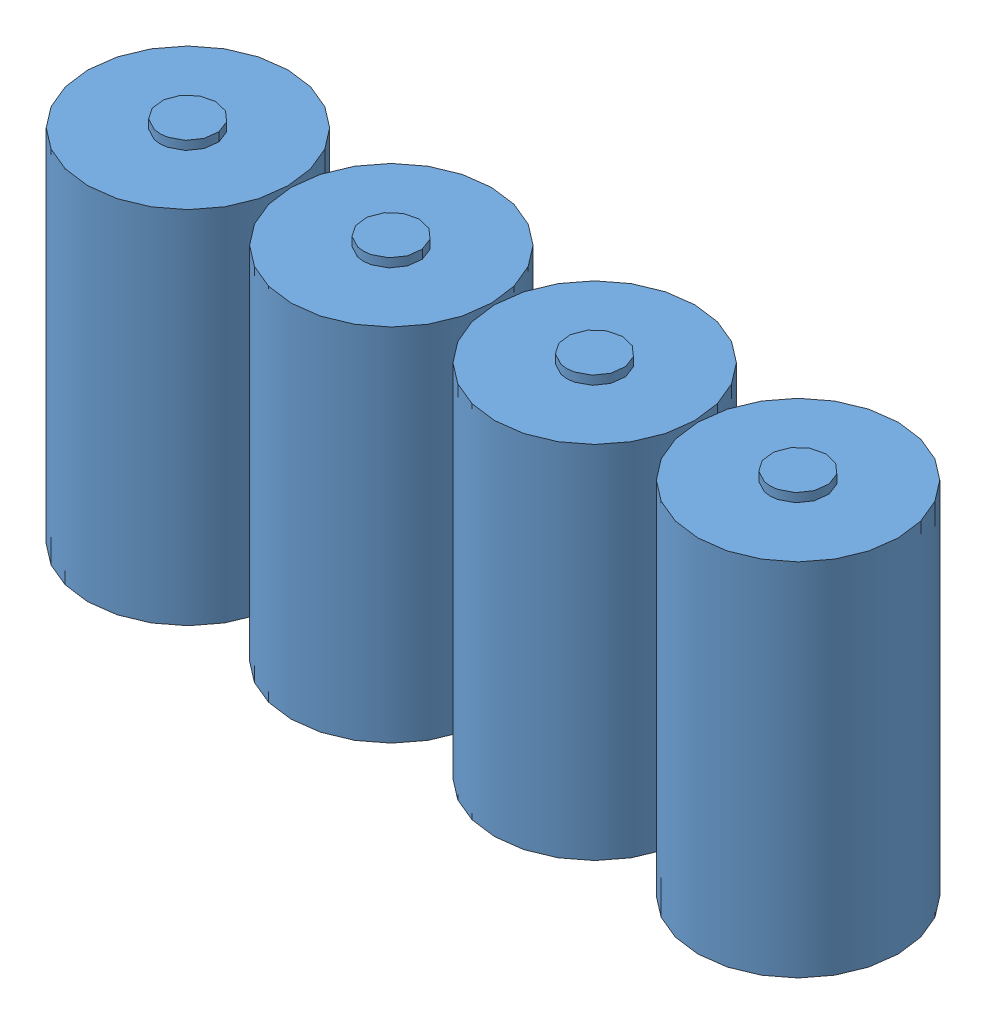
SolidWorks assembly MX1300 4 pack.SLDASM, configuration Default (file format 5000). Lengths in mm.
Overall size (138.32 63 34.2).
4 component instances, 1 part files, 11 mates.
Components (placement in the parent):
- Duracell MX1300 Alk-1: Duracell MX1300 Alk.SLDPRT [Default] at (13.6671 0 17.1) size (34.2 63 34.2)
- Duracell MX1300 Alk-2: Duracell MX1300 Alk.SLDPRT [Default] at (-21.0409 0 17.1) size (34.2 63 34.2)
- Duracell MX1300 Alk-3: Duracell MX1300 Alk.SLDPRT [Default] at (-55.7489 0 17.1) size (34.2 63 34.2)
- Duracell MX1300 Alk-4: Duracell MX1300 Alk.SLDPRT [Default] at (-90.4569 0 17.1) size (34.2 63 34.2)
Mates (geometry in assembly coordinates):
- Coincident2: coincident anti-aligned: plane of Duracell MX1300 Alk-4; plane of assembly
- Coincident3: coincident anti-aligned: plane of Duracell MX1300 Alk-3; plane of assembly
- Coincident4: coincident anti-aligned: plane of Duracell MX1300 Alk-2; plane of assembly
- Coincident6: coincident anti-aligned: plane of Duracell MX1300 Alk-1; plane of assembly
- Distance4: distance anti-aligned: cylinder of Duracell MX1300 Alk-4; plane of assembly
- Tangent2: tangent anti-aligned: cylinder of Duracell MX1300 Alk-3; plane of assembly
- Tangent3: tangent anti-aligned: cylinder of Duracell MX1300 Alk-2; plane of assembly
- Tangent4: tangent anti-aligned: cylinder of Duracell MX1300 Alk-1; plane of assembly
- Distance1: distance = 0.508 mm: cylinder of Duracell MX1300 Alk-3; cylinder of Duracell MX1300 Alk-4
- Distance2: distance = 0.508 mm: cylinder of Duracell MX1300 Alk-2; cylinder of Duracell MX1300 Alk-3
- Distance5: distance = 0.508 mm: cylinder of Duracell MX1300 Alk-1; cylinder of Duracell MX1300 Alk-2
